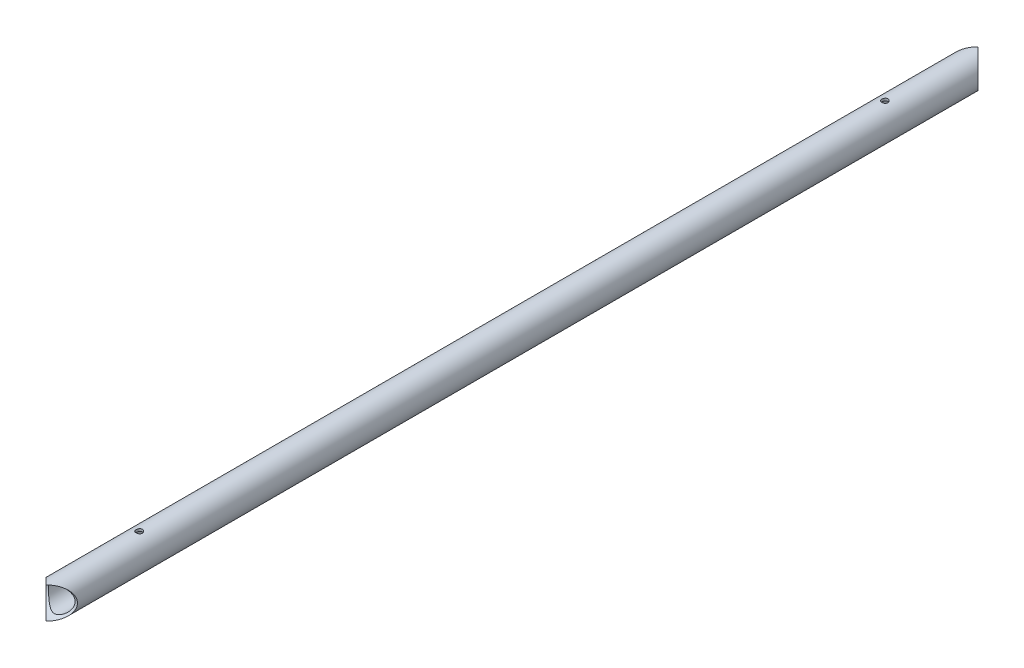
from build123d import *

# Parameters (mm, degrees)
SKETCH1_R          = 24.13
SKETCH1_R_2        = 20.447
EXTRUDE1_DEPTH     = 714.375
SKETCH2_R          = 24.13
CUT_EXTRUDE1_DEPTH = 38.1
SKETCH3_R          = 4.826
CUT_EXTRUDE2_DEPTH = 25.4


with BuildPart() as part:
    # Sketch1 → Extrude1 (new, symmetric)
    with BuildSketch(Plane.XY):
        Circle(SKETCH1_R)
        Circle(SKETCH1_R_2, mode=Mode.SUBTRACT)
    extrude(amount=EXTRUDE1_DEPTH, both=True)

    # Sketch2 → Cut-Extrude1 (cut, symmetric)
    with BuildSketch(Plane(origin=(0, 0, 0), x_dir=(0, 0, -1), z_dir=(1, 0, 0))):
        with Locations((-714.375, 0)):
            Circle(SKETCH2_R)
        with Locations((714.375, 0)):
            Circle(SKETCH2_R)
    extrude(amount=CUT_EXTRUDE1_DEPTH, both=True, mode=Mode.SUBTRACT)

    # Sketch3 → Cut-Extrude2 (cut, symmetric)
    with BuildSketch(Plane(origin=(0, 0, 0), x_dir=(1, 0, 0), z_dir=(0, 1, 0))):
        with Locations(Location((0, 571.5, 0), (0, 0, 270))):
            Circle(SKETCH3_R)
        with Locations(Location((0, -571.5, 0), (0, 0, 270))):
            Circle(SKETCH3_R)
    extrude(amount=CUT_EXTRUDE2_DEPTH, both=True, mode=Mode.SUBTRACT)


solid = part.part
